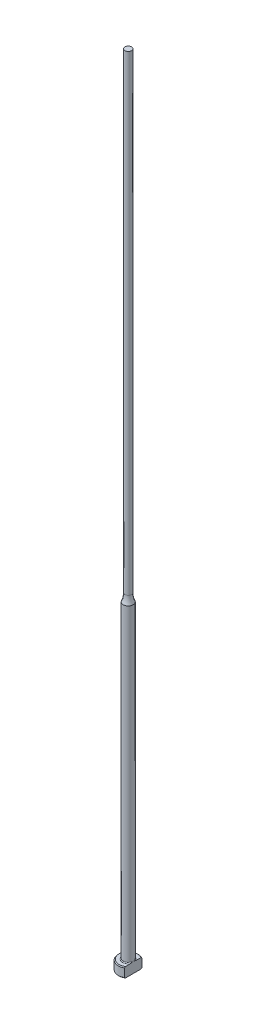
ISO-10303-21;
HEADER;
FILE_DESCRIPTION(('STEP AP214'),'2;1');
FILE_NAME('part.step','',(''),(''),'','','');
FILE_SCHEMA(('AUTOMOTIVE_DESIGN { 1 0 10303 214 1 1 1 1 }'));
ENDSEC;
DATA;
#1=APPLICATION_CONTEXT('core data for automotive mechanical design processes');
#2=APPLICATION_PROTOCOL_DEFINITION('international standard','automotive_design',2000,#1);
#3=PRODUCT_CONTEXT('',#1,'mechanical');
#4=PRODUCT('Part','Part','',(#3));
#5=PRODUCT_RELATED_PRODUCT_CATEGORY('part','',(#4));
#6=PRODUCT_DEFINITION_FORMATION('','',#4);
#7=PRODUCT_DEFINITION_CONTEXT('part definition',#1,'design');
#8=PRODUCT_DEFINITION('design','',#6,#7);
#9=PRODUCT_DEFINITION_SHAPE('','',#8);
#10=(LENGTH_UNIT() NAMED_UNIT(*) SI_UNIT(.MILLI.,.METRE.));
#11=(NAMED_UNIT(*) PLANE_ANGLE_UNIT() SI_UNIT($,.RADIAN.));
#12=(NAMED_UNIT(*) SI_UNIT($,.STERADIAN.) SOLID_ANGLE_UNIT());
#13=UNCERTAINTY_MEASURE_WITH_UNIT(LENGTH_MEASURE(1.E-05),#10,'distance_accuracy_value','');
#14=(GEOMETRIC_REPRESENTATION_CONTEXT(3) GLOBAL_UNCERTAINTY_ASSIGNED_CONTEXT((#13)) GLOBAL_UNIT_ASSIGNED_CONTEXT((#10,
#11,#12)) REPRESENTATION_CONTEXT('',''));
#15=CARTESIAN_POINT('',(0.,0.,0.));
#16=DIRECTION('',(0.,0.,1.));
#17=DIRECTION('',(1.,0.,0.));
#18=AXIS2_PLACEMENT_3D('',#15,#16,#17);
#19=CARTESIAN_POINT('',(-3.17499999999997,3.175,0.));
#20=DIRECTION('',(0.,1.,0.));
#21=DIRECTION('',(0.,0.,1.));
#22=AXIS2_PLACEMENT_3D('',#19,#20,#21);
#23=PLANE('',#22);
#24=CARTESIAN_POINT('',(0.,3.175,0.));
#25=DIRECTION('',(0.,1.,0.));
#26=DIRECTION('',(0.,0.,1.));
#27=AXIS2_PLACEMENT_3D('',#24,#25,#26);
#28=CIRCLE('',#27,2.92099999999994);
#29=CARTESIAN_POINT('',(1.58749999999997,3.175,-2.45195529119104));
#30=VERTEX_POINT('',#29);
#31=CARTESIAN_POINT('',(1.58749999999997,3.175,2.45195529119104));
#32=VERTEX_POINT('',#31);
#33=EDGE_CURVE('E105',#30,#32,#28,.T.);
#34=ORIENTED_EDGE('',*,*,#33,.T.);
#35=DIRECTION('',(0.,0.,1.));
#36=VECTOR('',#35,1.);
#37=CARTESIAN_POINT('',(1.58749999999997,3.17499999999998,2.74963065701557));
#38=LINE('',#37,#36);
#39=CARTESIAN_POINT('',(1.58749999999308,3.175,0.933255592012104));
#40=VERTEX_POINT('',#39);
#41=EDGE_CURVE('E126',#40,#32,#38,.T.);
#42=ORIENTED_EDGE('',*,*,#41,.F.);
#43=CARTESIAN_POINT('',(0.,3.175,0.));
#44=DIRECTION('',(0.,1.,0.));
#45=DIRECTION('',(0.,0.,1.));
#46=AXIS2_PLACEMENT_3D('',#43,#44,#45);
#47=CIRCLE('',#46,1.84149999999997);
#48=CARTESIAN_POINT('',(1.58749999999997,3.17500000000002,-0.933255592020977));
#49=VERTEX_POINT('',#48);
#50=EDGE_CURVE('E11',#40,#49,#47,.F.);
#51=ORIENTED_EDGE('',*,*,#50,.T.);
#52=EDGE_CURVE('E52',#30,#49,#38,.T.);
#53=ORIENTED_EDGE('',*,*,#52,.F.);
#54=EDGE_LOOP('',(#34,#42,#51,#53));
#55=FACE_BOUND('',#54,.T.);
#56=ADVANCED_FACE('F32',(#55),#23,.T.);
#57=CARTESIAN_POINT('',(0.,259.958771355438,0.));
#58=DIRECTION('',(0.,1.,0.));
#59=DIRECTION('',(0.,0.,1.));
#60=AXIS2_PLACEMENT_3D('',#57,#58,#59);
#61=CYLINDRICAL_SURFACE('',#60,3.17499999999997);
#62=CARTESIAN_POINT('',(0.,2.92100000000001,0.));
#63=DIRECTION('',(0.,1.,0.));
#64=DIRECTION('',(0.,0.,1.));
#65=AXIS2_PLACEMENT_3D('',#62,#63,#64);
#66=CIRCLE('',#65,3.17499999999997);
#67=CARTESIAN_POINT('',(1.58749999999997,2.92100000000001,2.74963065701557));
#68=VERTEX_POINT('',#67);
#69=CARTESIAN_POINT('',(1.58749999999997,2.92100000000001,-2.74963065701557));
#70=VERTEX_POINT('',#69);
#71=EDGE_CURVE('E98',#68,#70,#66,.F.);
#72=ORIENTED_EDGE('',*,*,#71,.T.);
#73=DIRECTION('',(0.,-1.,0.));
#74=VECTOR('',#73,1.);
#75=CARTESIAN_POINT('',(1.58749999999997,254.001,-2.74963065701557));
#76=LINE('',#75,#74);
#77=CARTESIAN_POINT('',(1.58749999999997,0.253999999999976,-2.74963065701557));
#78=VERTEX_POINT('',#77);
#79=EDGE_CURVE('E141',#70,#78,#76,.T.);
#80=ORIENTED_EDGE('',*,*,#79,.T.);
#81=CARTESIAN_POINT('',(0.,0.253999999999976,0.));
#82=DIRECTION('',(0.,-1.,0.));
#83=DIRECTION('',(0.,0.,-1.));
#84=AXIS2_PLACEMENT_3D('',#81,#82,#83);
#85=CIRCLE('',#84,3.17499999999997);
#86=CARTESIAN_POINT('',(1.58749999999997,0.253999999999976,2.74963065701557));
#87=VERTEX_POINT('',#86);
#88=EDGE_CURVE('E95',#78,#87,#85,.F.);
#89=ORIENTED_EDGE('',*,*,#88,.T.);
#90=DIRECTION('',(0.,-1.,0.));
#91=VECTOR('',#90,1.);
#92=CARTESIAN_POINT('',(1.58749999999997,254.001,2.74963065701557));
#93=LINE('',#92,#91);
#94=EDGE_CURVE('E88',#68,#87,#93,.T.);
#95=ORIENTED_EDGE('',*,*,#94,.F.);
#96=EDGE_LOOP('',(#72,#80,#89,#95));
#97=FACE_BOUND('',#96,.T.);
#98=ADVANCED_FACE('F191',(#97),#61,.T.);
#99=CARTESIAN_POINT('',(0.,0.,0.));
#100=DIRECTION('',(0.,-1.,0.));
#101=DIRECTION('',(0.,0.,-1.));
#102=AXIS2_PLACEMENT_3D('',#99,#100,#101);
#103=PLANE('',#102);
#104=CARTESIAN_POINT('',(0.,0.,0.));
#105=DIRECTION('',(0.,-1.,0.));
#106=DIRECTION('',(0.,0.,-1.));
#107=AXIS2_PLACEMENT_3D('',#104,#105,#106);
#108=CIRCLE('',#107,2.92100000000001);
#109=CARTESIAN_POINT('',(1.58749999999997,0.,2.45195529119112));
#110=VERTEX_POINT('',#109);
#111=CARTESIAN_POINT('',(1.58749999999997,0.,-2.45195529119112));
#112=VERTEX_POINT('',#111);
#113=EDGE_CURVE('E93',#110,#112,#108,.T.);
#114=ORIENTED_EDGE('',*,*,#113,.T.);
#115=DIRECTION('',(0.,0.,1.));
#116=VECTOR('',#115,1.);
#117=CARTESIAN_POINT('',(1.58749999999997,0.,2.74963065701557));
#118=LINE('',#117,#116);
#119=EDGE_CURVE('E78',#112,#110,#118,.T.);
#120=ORIENTED_EDGE('',*,*,#119,.T.);
#121=EDGE_LOOP('',(#114,#120));
#122=FACE_BOUND('',#121,.T.);
#123=ADVANCED_FACE('F97',(#122),#103,.T.);
#124=CARTESIAN_POINT('',(0.,3.17499999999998,0.));
#125=DIRECTION('',(0.,-1.,0.));
#126=DIRECTION('',(0.,0.,-1.));
#127=AXIS2_PLACEMENT_3D('',#124,#125,#126);
#128=CONICAL_SURFACE('',#127,2.92099999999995,0.785398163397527);
#129=ORIENTED_EDGE('',*,*,#71,.F.);
#130=CARTESIAN_POINT('',(1.58749999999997,-0.16162066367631,-6.0529050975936));
#131=CARTESIAN_POINT('',(1.58749999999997,-0.0288893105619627,-5.91567682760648));
#132=CARTESIAN_POINT('',(1.58749999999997,0.103699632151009,-5.7783103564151));
#133=CARTESIAN_POINT('',(1.58749999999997,0.368508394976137,-5.50321874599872));
#134=CARTESIAN_POINT('',(1.58749999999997,0.500728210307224,-5.36549360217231));
#135=CARTESIAN_POINT('',(1.58749999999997,0.764778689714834,-5.08953516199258));
#136=CARTESIAN_POINT('',(1.58749999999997,0.896609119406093,-4.9513016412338));
#137=CARTESIAN_POINT('',(1.58749999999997,1.15968706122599,-4.67428233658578));
#138=CARTESIAN_POINT('',(1.58749999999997,1.29093457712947,-4.53549655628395));
#139=CARTESIAN_POINT('',(1.58749999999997,1.55007705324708,-4.25997724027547));
#140=CARTESIAN_POINT('',(1.58749999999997,1.67798684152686,-4.12325766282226));
#141=CARTESIAN_POINT('',(1.58749999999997,1.9328486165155,-3.84892898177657));
#142=CARTESIAN_POINT('',(1.58749999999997,2.05980060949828,-3.71131988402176));
#143=CARTESIAN_POINT('',(1.58749999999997,2.31237508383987,-3.43493978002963));
#144=CARTESIAN_POINT('',(1.58749999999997,2.43799784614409,-3.29616903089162));
#145=CARTESIAN_POINT('',(1.58749999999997,2.68741369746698,-3.01699558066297));
#146=CARTESIAN_POINT('',(1.58749999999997,2.81120686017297,-2.8765929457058));
#147=CARTESIAN_POINT('',(1.58749999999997,3.00875865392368,-2.64816703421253));
#148=CARTESIAN_POINT('',(1.58749999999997,3.08336151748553,-2.56087478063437));
#149=CARTESIAN_POINT('',(1.58749999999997,3.2312387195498,-2.38515423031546));
#150=CARTESIAN_POINT('',(1.58749999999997,3.30451292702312,-2.29672582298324));
#151=CARTESIAN_POINT('',(1.58749999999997,3.45004422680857,-2.1174740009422));
#152=CARTESIAN_POINT('',(1.58749999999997,3.5222823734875,-2.02663514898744));
#153=CARTESIAN_POINT('',(1.58749999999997,3.66423097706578,-1.8430252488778));
#154=CARTESIAN_POINT('',(1.58749999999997,3.73394203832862,-1.75025467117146));
#155=CARTESIAN_POINT('',(1.58749999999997,3.87080633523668,-1.5606747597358));
#156=CARTESIAN_POINT('',(1.58749999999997,3.93790459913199,-1.46382547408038));
#157=CARTESIAN_POINT('',(1.58749999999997,4.06669147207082,-1.26632594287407));
#158=CARTESIAN_POINT('',(1.58749999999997,4.1283726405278,-1.16567073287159));
#159=CARTESIAN_POINT('',(1.58749999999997,4.21402252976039,-1.01165766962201));
#160=CARTESIAN_POINT('',(1.58749999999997,4.24127929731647,-0.960142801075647));
#161=CARTESIAN_POINT('',(1.58749999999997,4.2930979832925,-0.855780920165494));
#162=CARTESIAN_POINT('',(1.58749999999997,4.31765941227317,-0.802933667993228));
#163=CARTESIAN_POINT('',(1.58749999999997,4.38614656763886,-0.642461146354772));
#164=CARTESIAN_POINT('',(1.58749999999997,4.42510149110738,-0.532518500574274));
#165=CARTESIAN_POINT('',(1.58749999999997,4.46726244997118,-0.367680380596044));
#166=CARTESIAN_POINT('',(1.58749999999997,4.47844427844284,-0.314802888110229));
#167=CARTESIAN_POINT('',(1.58749999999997,4.49576654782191,-0.208209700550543));
#168=CARTESIAN_POINT('',(1.58749999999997,4.50190743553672,-0.154494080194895));
#169=CARTESIAN_POINT('',(1.58749999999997,4.50871296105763,-0.0468792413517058));
#170=CARTESIAN_POINT('',(1.58749999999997,4.5093945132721,0.00701889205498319));
#171=CARTESIAN_POINT('',(1.58749999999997,4.50527679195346,0.114606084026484));
#172=CARTESIAN_POINT('',(1.58749999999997,4.50047706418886,0.168295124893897));
#173=CARTESIAN_POINT('',(1.58749999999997,4.48579689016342,0.27448544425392));
#174=CARTESIAN_POINT('',(1.58749999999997,4.47596081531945,0.32699298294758));
#175=CARTESIAN_POINT('',(1.58749999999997,4.45181809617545,0.430974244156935));
#176=CARTESIAN_POINT('',(1.58749999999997,4.4375096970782,0.482447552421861));
#177=CARTESIAN_POINT('',(1.58749999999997,4.40502489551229,0.584460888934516));
#178=CARTESIAN_POINT('',(1.58749999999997,4.386827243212,0.634994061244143));
#179=CARTESIAN_POINT('',(1.58749999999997,4.34729308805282,0.734789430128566));
#180=CARTESIAN_POINT('',(1.58749999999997,4.3259572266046,0.784051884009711));
#181=CARTESIAN_POINT('',(1.58749999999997,4.25791922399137,0.930549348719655));
#182=CARTESIAN_POINT('',(1.58749999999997,4.20736047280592,1.0259880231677));
#183=CARTESIAN_POINT('',(1.58749999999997,4.0995545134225,1.21304313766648));
#184=CARTESIAN_POINT('',(1.58749999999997,4.04229912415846,1.30465471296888));
#185=CARTESIAN_POINT('',(1.58749999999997,3.92308746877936,1.48526211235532));
#186=CARTESIAN_POINT('',(1.58749999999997,3.86111349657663,1.57424615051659));
#187=CARTESIAN_POINT('',(1.58749999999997,3.73408621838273,1.74990003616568));
#188=CARTESIAN_POINT('',(1.58749999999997,3.66903444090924,1.83657099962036));
#189=CARTESIAN_POINT('',(1.58749999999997,3.53583371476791,2.00931764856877));
#190=CARTESIAN_POINT('',(1.58749999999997,3.46765527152,2.09537048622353));
#191=CARTESIAN_POINT('',(1.58749999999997,3.32960643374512,2.26611736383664));
#192=CARTESIAN_POINT('',(1.58749999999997,3.25973586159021,2.35081125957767));
#193=CARTESIAN_POINT('',(1.58749999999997,3.04858139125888,2.60290121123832));
#194=CARTESIAN_POINT('',(1.58749999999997,2.90542388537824,2.76872537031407));
#195=CARTESIAN_POINT('',(1.58749999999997,2.64069522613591,3.06970913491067));
#196=CARTESIAN_POINT('',(1.58749999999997,2.51959458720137,3.20528660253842));
#197=CARTESIAN_POINT('',(1.58749999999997,2.27590400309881,3.47510321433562));
#198=CARTESIAN_POINT('',(1.58749999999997,2.15331401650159,3.60934232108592));
#199=CARTESIAN_POINT('',(1.58749999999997,1.90694239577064,3.87695374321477));
#200=CARTESIAN_POINT('',(1.58749999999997,1.78315974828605,4.0103251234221));
#201=CARTESIAN_POINT('',(1.58749999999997,1.53478104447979,4.27630880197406));
#202=CARTESIAN_POINT('',(1.58749999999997,1.41018498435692,4.40892109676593));
#203=CARTESIAN_POINT('',(1.58749999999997,1.0457468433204,4.79499418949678));
#204=CARTESIAN_POINT('',(1.58749999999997,0.80507680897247,5.04767313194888));
#205=CARTESIAN_POINT('',(1.58749999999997,0.443121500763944,5.42550911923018));
#206=CARTESIAN_POINT('',(1.58749999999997,0.322378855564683,5.55118772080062));
#207=CARTESIAN_POINT('',(1.58749999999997,0.0805914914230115,5.80225207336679));
#208=CARTESIAN_POINT('',(1.58749999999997,-0.040453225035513,5.92763782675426));
#209=CARTESIAN_POINT('',(1.58749999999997,-0.161620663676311,6.0529050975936));
#210=B_SPLINE_CURVE_WITH_KNOTS('',3,(#130,#131,#132,#133,#134,#135,#136,#137,#138,#139,#140,
#141,#142,#143,#144,#145,#146,#147,#148,#149,#150,#151,#152,#153,#154,#155,#156,#157,#158,#159,
#160,#161,#162,#163,#164,#165,#166,#167,#168,#169,#170,#171,#172,#173,#174,#175,#176,#177,#178,
#179,#180,#181,#182,#183,#184,#185,#186,#187,#188,#189,#190,#191,#192,#193,#194,#195,#196,#197,
#198,#199,#200,#201,#202,#203,#204,#205,#206,#207,#208,#209),.UNSPECIFIED.,.F.,.F.,(4,2,2,2,2,2,
2,2,2,2,2,2,2,2,2,2,2,2,2,2,2,2,2,2,2,2,2,2,2,2,2,2,2,2,2,2,2,2,2,4),(0.,0.572750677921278,
1.14550874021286,1.71856057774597,2.29160869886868,2.85328006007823,3.4149477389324,
3.97649423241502,4.53801804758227,4.88249307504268,5.22700189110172,5.5751532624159,
5.92322081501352,6.27657800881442,6.63041319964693,6.80518126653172,6.9799810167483,
7.3282426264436,7.49018491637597,7.65211285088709,7.81353889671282,7.97497832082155,
8.13501929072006,8.29512313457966,8.45612518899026,8.61709438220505,8.94062993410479,
9.2645649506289,9.58978187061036,9.91483894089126,10.2441741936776,10.5735441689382,
11.2306812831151,11.7760337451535,12.3214014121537,12.8672825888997,13.4131663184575,
14.4600164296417,14.9828595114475,15.5056983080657),.UNSPECIFIED.);
#211=EDGE_CURVE('E118',#32,#68,#210,.T.);
#212=ORIENTED_EDGE('',*,*,#211,.F.);
#213=ORIENTED_EDGE('',*,*,#33,.F.);
#214=EDGE_CURVE('E117',#70,#30,#210,.T.);
#215=ORIENTED_EDGE('',*,*,#214,.F.);
#216=EDGE_LOOP('',(#129,#212,#213,#215));
#217=FACE_BOUND('',#216,.T.);
#218=ADVANCED_FACE('F162',(#217),#128,.T.);
#219=CARTESIAN_POINT('',(0.,0.253999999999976,0.));
#220=DIRECTION('',(0.,1.,0.));
#221=DIRECTION('',(0.,0.,1.));
#222=AXIS2_PLACEMENT_3D('',#219,#220,#221);
#223=CONICAL_SURFACE('',#222,3.17499999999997,0.785398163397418);
#224=ORIENTED_EDGE('',*,*,#88,.F.);
#225=CARTESIAN_POINT('',(1.58749999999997,3.33662066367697,6.0529050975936));
#226=CARTESIAN_POINT('',(1.58749999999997,3.20388931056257,5.91567682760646));
#227=CARTESIAN_POINT('',(1.58749999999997,3.07130036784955,5.77831035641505));
#228=CARTESIAN_POINT('',(1.58749999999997,2.80649160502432,5.50321874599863));
#229=CARTESIAN_POINT('',(1.58749999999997,2.67427178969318,5.3654936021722));
#230=CARTESIAN_POINT('',(1.58749999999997,2.41022131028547,5.08953516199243));
#231=CARTESIAN_POINT('',(1.58749999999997,2.27839088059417,4.95130164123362));
#232=CARTESIAN_POINT('',(1.58749999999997,2.01531293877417,4.67428233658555));
#233=CARTESIAN_POINT('',(1.58749999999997,1.88406542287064,4.5354965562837));
#234=CARTESIAN_POINT('',(1.58749999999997,1.62492294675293,4.25997724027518));
#235=CARTESIAN_POINT('',(1.58749999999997,1.49701315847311,4.12325766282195));
#236=CARTESIAN_POINT('',(1.58749999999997,1.24215138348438,3.84892898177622));
#237=CARTESIAN_POINT('',(1.58749999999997,1.11519939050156,3.71131988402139));
#238=CARTESIAN_POINT('',(1.58749999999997,0.862624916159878,3.43493978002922));
#239=CARTESIAN_POINT('',(1.58749999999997,0.737002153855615,3.29616903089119));
#240=CARTESIAN_POINT('',(1.58749999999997,0.487586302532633,3.01699558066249));
#241=CARTESIAN_POINT('',(1.58749999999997,0.363793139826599,2.8765929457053));
#242=CARTESIAN_POINT('',(1.58749999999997,0.166241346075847,2.64816703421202));
#243=CARTESIAN_POINT('',(1.58749999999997,0.0916384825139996,2.56087478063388));
#244=CARTESIAN_POINT('',(1.58749999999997,-0.0562387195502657,2.385154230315));
#245=CARTESIAN_POINT('',(1.58749999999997,-0.129512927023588,2.29672582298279));
#246=CARTESIAN_POINT('',(1.58749999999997,-0.27504422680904,2.11747400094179));
#247=CARTESIAN_POINT('',(1.58749999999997,-0.347282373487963,2.02663514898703));
#248=CARTESIAN_POINT('',(1.58749999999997,-0.489230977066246,1.84302524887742));
#249=CARTESIAN_POINT('',(1.58749999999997,-0.558942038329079,1.7502546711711));
#250=CARTESIAN_POINT('',(1.58749999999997,-0.695806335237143,1.56067475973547));
#251=CARTESIAN_POINT('',(1.58749999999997,-0.762904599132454,1.46382547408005));
#252=CARTESIAN_POINT('',(1.58749999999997,-0.891691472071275,1.26632594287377));
#253=CARTESIAN_POINT('',(1.58749999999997,-0.953372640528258,1.16567073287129));
#254=CARTESIAN_POINT('',(1.58749999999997,-1.03902252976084,1.01165766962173));
#255=CARTESIAN_POINT('',(1.58749999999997,-1.06627929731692,0.960142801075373));
#256=CARTESIAN_POINT('',(1.58749999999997,-1.11809798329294,0.85578092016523));
#257=CARTESIAN_POINT('',(1.58749999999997,-1.14265941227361,0.802933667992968));
#258=CARTESIAN_POINT('',(1.58749999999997,-1.21114656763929,0.642461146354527));
#259=CARTESIAN_POINT('',(1.58749999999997,-1.2501014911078,0.532518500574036));
#260=CARTESIAN_POINT('',(1.58749999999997,-1.29226244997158,0.367680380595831));
#261=CARTESIAN_POINT('',(1.58749999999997,-1.30344427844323,0.314802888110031));
#262=CARTESIAN_POINT('',(1.58749999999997,-1.32076654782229,0.208209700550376));
#263=CARTESIAN_POINT('',(1.58749999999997,-1.3269074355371,0.154494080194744));
#264=CARTESIAN_POINT('',(1.58749999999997,-1.333712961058,0.0468792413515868));
#265=CARTESIAN_POINT('',(1.58749999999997,-1.33439451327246,-0.00701889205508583));
#266=CARTESIAN_POINT('',(1.58749999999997,-1.33027679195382,-0.114606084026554));
#267=CARTESIAN_POINT('',(1.58749999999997,-1.32547706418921,-0.168295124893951));
#268=CARTESIAN_POINT('',(1.58749999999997,-1.31079689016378,-0.274485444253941));
#269=CARTESIAN_POINT('',(1.58749999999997,-1.3009608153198,-0.326992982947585));
#270=CARTESIAN_POINT('',(1.58749999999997,-1.27681809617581,-0.430974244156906));
#271=CARTESIAN_POINT('',(1.58749999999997,-1.26250969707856,-0.482447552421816));
#272=CARTESIAN_POINT('',(1.58749999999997,-1.23002489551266,-0.584460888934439));
#273=CARTESIAN_POINT('',(1.58749999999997,-1.21182724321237,-0.634994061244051));
#274=CARTESIAN_POINT('',(1.58749999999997,-1.1722930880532,-0.734789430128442));
#275=CARTESIAN_POINT('',(1.58749999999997,-1.15095722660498,-0.784051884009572));
#276=CARTESIAN_POINT('',(1.58749999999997,-1.08291922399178,-0.93054934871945));
#277=CARTESIAN_POINT('',(1.58749999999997,-1.03236047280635,-1.02598802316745));
#278=CARTESIAN_POINT('',(1.58749999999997,-0.924554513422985,-1.21304313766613));
#279=CARTESIAN_POINT('',(1.58749999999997,-0.86729912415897,-1.30465471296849));
#280=CARTESIAN_POINT('',(1.58749999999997,-0.748087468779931,-1.48526211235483));
#281=CARTESIAN_POINT('',(1.58749999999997,-0.686113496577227,-1.57424615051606));
#282=CARTESIAN_POINT('',(1.58749999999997,-0.55908621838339,-1.74990003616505));
#283=CARTESIAN_POINT('',(1.58749999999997,-0.494034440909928,-1.83657099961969));
#284=CARTESIAN_POINT('',(1.58749999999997,-0.360833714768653,-2.00931764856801));
#285=CARTESIAN_POINT('',(1.58749999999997,-0.292655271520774,-2.09537048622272));
#286=CARTESIAN_POINT('',(1.58749999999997,-0.154606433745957,-2.26611736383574));
#287=CARTESIAN_POINT('',(1.58749999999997,-0.0847358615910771,-2.35081125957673));
#288=CARTESIAN_POINT('',(1.58749999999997,0.126418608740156,-2.60290121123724));
#289=CARTESIAN_POINT('',(1.58749999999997,0.269576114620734,-2.76872537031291));
#290=CARTESIAN_POINT('',(1.58749999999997,0.534304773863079,-3.06970913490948));
#291=CARTESIAN_POINT('',(1.58749999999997,0.655405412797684,-3.20528660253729));
#292=CARTESIAN_POINT('',(1.58749999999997,0.899095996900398,-3.47510321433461));
#293=CARTESIAN_POINT('',(1.58749999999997,1.02168598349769,-3.60934232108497));
#294=CARTESIAN_POINT('',(1.58749999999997,1.26805760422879,-3.87695374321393));
#295=CARTESIAN_POINT('',(1.58749999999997,1.39184025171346,-4.01032512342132));
#296=CARTESIAN_POINT('',(1.58749999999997,1.64021895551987,-4.2763088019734));
#297=CARTESIAN_POINT('',(1.58749999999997,1.76481501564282,-4.40892109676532));
#298=CARTESIAN_POINT('',(1.58749999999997,2.12925315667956,-4.79499418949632));
#299=CARTESIAN_POINT('',(1.58749999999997,2.36992319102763,-5.04767313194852));
#300=CARTESIAN_POINT('',(1.58749999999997,2.73187849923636,-5.42550911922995));
#301=CARTESIAN_POINT('',(1.58749999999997,2.85262114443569,-5.55118772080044));
#302=CARTESIAN_POINT('',(1.58749999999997,3.09440850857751,-5.8022520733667));
#303=CARTESIAN_POINT('',(1.58749999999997,3.2154532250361,-5.92763782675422));
#304=CARTESIAN_POINT('',(1.58749999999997,3.33662066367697,-6.0529050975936));
#305=B_SPLINE_CURVE_WITH_KNOTS('',3,(#225,#226,#227,#228,#229,#230,#231,#232,#233,#234,#235,
#236,#237,#238,#239,#240,#241,#242,#243,#244,#245,#246,#247,#248,#249,#250,#251,#252,#253,#254,
#255,#256,#257,#258,#259,#260,#261,#262,#263,#264,#265,#266,#267,#268,#269,#270,#271,#272,#273,
#274,#275,#276,#277,#278,#279,#280,#281,#282,#283,#284,#285,#286,#287,#288,#289,#290,#291,#292,
#293,#294,#295,#296,#297,#298,#299,#300,#301,#302,#303,#304),.UNSPECIFIED.,.F.,.F.,(4,2,2,2,2,2,
2,2,2,2,2,2,2,2,2,2,2,2,2,2,2,2,2,2,2,2,2,2,2,2,2,2,2,2,2,2,2,2,2,4),(0.,0.57275067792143,
1.14550874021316,1.71856057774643,2.29160869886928,2.85328006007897,3.41494773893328,
3.97649423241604,4.53801804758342,4.88249307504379,5.2270018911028,5.57515326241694,
5.92322081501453,6.27657800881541,6.63041319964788,6.80518126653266,6.97998101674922,
7.32824262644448,7.49018491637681,7.65211285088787,7.81353889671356,7.97497832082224,
8.1350192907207,8.29512313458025,8.45612518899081,8.61709438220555,8.94062993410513,
9.26456495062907,9.58978187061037,9.91483894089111,10.2441741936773,10.5735441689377,
11.2306812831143,11.776033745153,12.3214014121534,12.8672825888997,13.4131663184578,
14.4600164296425,14.9828595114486,15.505698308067),.UNSPECIFIED.);
#306=EDGE_CURVE('E81',#112,#78,#305,.T.);
#307=ORIENTED_EDGE('',*,*,#306,.F.);
#308=ORIENTED_EDGE('',*,*,#113,.F.);
#309=EDGE_CURVE('E84',#87,#110,#305,.T.);
#310=ORIENTED_EDGE('',*,*,#309,.F.);
#311=EDGE_LOOP('',(#224,#307,#308,#310));
#312=FACE_BOUND('',#311,.T.);
#313=ADVANCED_FACE('F92',(#312),#223,.T.);
#314=CARTESIAN_POINT('',(0.,3.42900000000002,0.));
#315=DIRECTION('',(0.,1.,0.));
#316=DIRECTION('',(0.,0.,1.));
#317=AXIS2_PLACEMENT_3D('',#314,#315,#316);
#318=TOROIDAL_SURFACE('',#317,1.84149999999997,0.254);
#319=CARTESIAN_POINT('',(1.58749999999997,3.42900000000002,0.));
#320=CARTESIAN_POINT('',(1.58749999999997,3.42899942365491,-1.9220514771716E-10));
#321=CARTESIAN_POINT('',(1.58749999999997,3.42899884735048,-1.2261161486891E-07));
#322=CARTESIAN_POINT('',(1.58749999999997,3.42899773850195,-5.09676365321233E-07));
#323=CARTESIAN_POINT('',(1.58749999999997,3.42899720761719,-7.78176328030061E-07));
#324=CARTESIAN_POINT('',(1.58749999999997,3.42899614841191,-1.42307272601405E-06));
#325=CARTESIAN_POINT('',(1.58749999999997,3.42899562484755,-1.80713867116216E-06));
#326=CARTESIAN_POINT('',(1.58749999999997,3.42899463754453,-2.63494846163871E-06));
#327=CARTESIAN_POINT('',(1.58749999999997,3.42899417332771,-3.07814756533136E-06));
#328=CARTESIAN_POINT('',(1.58749999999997,3.42899261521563,-4.66897357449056E-06));
#329=CARTESIAN_POINT('',(1.58749999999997,3.42899159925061,-5.89404908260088E-06));
#330=CARTESIAN_POINT('',(1.58749999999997,3.42898979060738,-8.42427511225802E-06));
#331=CARTESIAN_POINT('',(1.58749999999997,3.42898899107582,-9.7248057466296E-06));
#332=CARTESIAN_POINT('',(1.58749999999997,3.42898598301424,-1.48060601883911E-05));
#333=CARTESIAN_POINT('',(1.58749999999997,3.42898393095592,-1.86838281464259E-05));
#334=CARTESIAN_POINT('',(1.58749999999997,3.42898057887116,-2.63261117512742E-05));
#335=CARTESIAN_POINT('',(1.58749999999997,3.42897922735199,-3.00687417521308E-05));
#336=CARTESIAN_POINT('',(1.58749999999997,3.42897347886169,-4.60276298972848E-05));
#337=CARTESIAN_POINT('',(1.58749999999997,3.42896911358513,-5.8247019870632E-05));
#338=CARTESIAN_POINT('',(1.58749999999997,3.42896211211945,-8.11070097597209E-05));
#339=CARTESIAN_POINT('',(1.58749999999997,3.42895931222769,-9.16953114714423E-05));
#340=CARTESIAN_POINT('',(1.58749999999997,3.42893712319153,-0.000168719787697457));
#341=CARTESIAN_POINT('',(1.58749999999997,3.42890881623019,-0.000232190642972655));
#342=CARTESIAN_POINT('',(1.58749999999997,3.42880276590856,-0.000479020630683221));
#343=CARTESIAN_POINT('',(1.58749999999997,3.42873165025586,-0.00066443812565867));
#344=CARTESIAN_POINT('',(1.58749999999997,3.42845137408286,-0.0013844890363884));
#345=CARTESIAN_POINT('',(1.58749999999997,3.42823526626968,-0.00191701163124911));
#346=CARTESIAN_POINT('',(1.58749999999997,3.42735449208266,-0.00409774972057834));
#347=CARTESIAN_POINT('',(1.58749999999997,3.42669768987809,-0.00574830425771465));
#348=CARTESIAN_POINT('',(1.58749999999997,3.4174405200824,-0.0289985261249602));
#349=CARTESIAN_POINT('',(1.58749999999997,3.40878325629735,-0.0505816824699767));
#350=CARTESIAN_POINT('',(1.58749999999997,3.39189297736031,-0.0929947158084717));
#351=CARTESIAN_POINT('',(1.58749999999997,3.38365605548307,-0.11382315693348));
#352=CARTESIAN_POINT('',(1.58749999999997,3.36635393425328,-0.157956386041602));
#353=CARTESIAN_POINT('',(1.58749999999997,3.35730391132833,-0.181267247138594));
#354=CARTESIAN_POINT('',(1.58749999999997,3.33936775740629,-0.228222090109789));
#355=CARTESIAN_POINT('',(1.58749999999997,3.33048420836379,-0.25186705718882));
#356=CARTESIAN_POINT('',(1.58749999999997,3.30894496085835,-0.310512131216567));
#357=CARTESIAN_POINT('',(1.58749999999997,3.29649449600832,-0.345588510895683));
#358=CARTESIAN_POINT('',(1.58749999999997,3.27296975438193,-0.415278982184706));
#359=CARTESIAN_POINT('',(1.58749999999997,3.26186987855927,-0.449884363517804));
#360=CARTESIAN_POINT('',(1.58749999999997,3.2395832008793,-0.524471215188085));
#361=CARTESIAN_POINT('',(1.58749999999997,3.22860862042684,-0.564517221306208));
#362=CARTESIAN_POINT('',(1.58749999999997,3.20902534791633,-0.645529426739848));
#363=CARTESIAN_POINT('',(1.58749999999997,3.20043582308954,-0.686500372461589));
#364=CARTESIAN_POINT('',(1.58749999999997,3.18611712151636,-0.771546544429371));
#365=CARTESIAN_POINT('',(1.58749999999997,3.18059550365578,-0.815658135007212));
#366=CARTESIAN_POINT('',(1.58749999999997,3.17455396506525,-0.904117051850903));
#367=CARTESIAN_POINT('',(1.58749999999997,3.17401361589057,-0.948462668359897));
#368=CARTESIAN_POINT('',(1.58749999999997,3.17898948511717,-1.02531896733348));
#369=CARTESIAN_POINT('',(1.58749999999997,3.1829739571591,-1.05792141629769));
#370=CARTESIAN_POINT('',(1.58749999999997,3.19569167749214,-1.12184393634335));
#371=CARTESIAN_POINT('',(1.58749999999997,3.20436049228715,-1.1531753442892));
#372=CARTESIAN_POINT('',(1.58749999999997,3.22236152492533,-1.19946468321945));
#373=CARTESIAN_POINT('',(1.58749999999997,3.2295150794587,-1.21526783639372));
#374=CARTESIAN_POINT('',(1.58749999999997,3.24587062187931,-1.24583726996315));
#375=CARTESIAN_POINT('',(1.58749999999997,3.25507530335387,-1.26060215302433));
#376=CARTESIAN_POINT('',(1.58749999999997,3.27378481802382,-1.28575815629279));
#377=CARTESIAN_POINT('',(1.58749999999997,3.28289001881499,-1.29644383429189));
#378=CARTESIAN_POINT('',(1.58749999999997,3.30268460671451,-1.31623154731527));
#379=CARTESIAN_POINT('',(1.58749999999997,3.31337067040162,-1.32533681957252));
#380=CARTESIAN_POINT('',(1.58749999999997,3.33349977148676,-1.33941140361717));
#381=CARTESIAN_POINT('',(1.58749999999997,3.34261446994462,-1.34484814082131));
#382=CARTESIAN_POINT('',(1.58749999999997,3.36161455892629,-1.35416329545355));
#383=CARTESIAN_POINT('',(1.58749999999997,3.37149946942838,-1.35804267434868));
#384=CARTESIAN_POINT('',(1.58749999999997,3.39188678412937,-1.36398436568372));
#385=CARTESIAN_POINT('',(1.58749999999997,3.40239309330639,-1.36603350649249));
#386=CARTESIAN_POINT('',(1.58749999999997,3.42360372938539,-1.3680840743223));
#387=CARTESIAN_POINT('',(1.58749999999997,3.43430795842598,-1.36808648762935));
#388=CARTESIAN_POINT('',(1.58749999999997,3.45433283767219,-1.36616208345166));
#389=CARTESIAN_POINT('',(1.58749999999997,3.46367506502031,-1.36444960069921));
#390=CARTESIAN_POINT('',(1.58749999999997,3.48195519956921,-1.35953338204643));
#391=CARTESIAN_POINT('',(1.58749999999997,3.49089304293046,-1.3563294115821));
#392=CARTESIAN_POINT('',(1.58749999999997,3.50850302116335,-1.34848006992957));
#393=CARTESIAN_POINT('',(1.58749999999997,3.5171531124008,-1.34378578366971));
#394=CARTESIAN_POINT('',(1.58749999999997,3.53371257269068,-1.33324445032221));
#395=CARTESIAN_POINT('',(1.58749999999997,3.54162163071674,-1.32739692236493));
#396=CARTESIAN_POINT('',(1.58749999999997,3.56107121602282,-1.31107304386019));
#397=CARTESIAN_POINT('',(1.58749999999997,3.57202221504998,-1.29989286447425));
#398=CARTESIAN_POINT('',(1.58749999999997,3.59202509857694,-1.27593566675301));
#399=CARTESIAN_POINT('',(1.58749999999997,3.60107086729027,-1.26315370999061));
#400=CARTESIAN_POINT('',(1.58749999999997,3.62186023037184,-1.22930733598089));
#401=CARTESIAN_POINT('',(1.58749999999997,3.63240584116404,-1.20751096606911));
#402=CARTESIAN_POINT('',(1.58749999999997,3.65004643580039,-1.16266144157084));
#403=CARTESIAN_POINT('',(1.58749999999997,3.65714435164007,-1.13960937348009));
#404=CARTESIAN_POINT('',(1.58749999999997,3.67265428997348,-1.07603916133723));
#405=CARTESIAN_POINT('',(1.58749999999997,3.67834921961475,-1.03486686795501));
#406=CARTESIAN_POINT('',(1.58749999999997,3.68382880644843,-0.951558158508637));
#407=CARTESIAN_POINT('',(1.58749999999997,3.68350976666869,-0.909417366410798));
#408=CARTESIAN_POINT('',(1.58749999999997,3.67745397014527,-0.811383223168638));
#409=CARTESIAN_POINT('',(1.58749999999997,3.66993873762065,-0.755610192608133));
#410=CARTESIAN_POINT('',(1.58749999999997,3.64933373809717,-0.644937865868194));
#411=CARTESIAN_POINT('',(1.58749999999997,3.63621897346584,-0.59004364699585));
#412=CARTESIAN_POINT('',(1.58749999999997,3.60740922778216,-0.485757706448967));
#413=CARTESIAN_POINT('',(1.58749999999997,3.59201096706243,-0.436281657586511));
#414=CARTESIAN_POINT('',(1.58749999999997,3.55922497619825,-0.338551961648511));
#415=CARTESIAN_POINT('',(1.58749999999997,3.5418584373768,-0.290291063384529));
#416=CARTESIAN_POINT('',(1.58749999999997,3.51760237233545,-0.225557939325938));
#417=CARTESIAN_POINT('',(1.58749999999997,3.51126413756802,-0.208874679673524));
#418=CARTESIAN_POINT('',(1.58749999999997,3.49830042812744,-0.17512392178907));
#419=CARTESIAN_POINT('',(1.58749999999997,3.49167176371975,-0.158057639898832));
#420=CARTESIAN_POINT('',(1.58749999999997,3.47585523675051,-0.117638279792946));
#421=CARTESIAN_POINT('',(1.58749999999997,3.46662970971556,-0.0943002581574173));
#422=CARTESIAN_POINT('',(1.58749999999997,3.44889695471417,-0.0497824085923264));
#423=CARTESIAN_POINT('',(1.58749999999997,3.44040039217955,-0.028598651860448));
#424=CARTESIAN_POINT('',(1.58749999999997,3.43130364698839,-0.00575168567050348));
#425=CARTESIAN_POINT('',(1.58749999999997,3.43064818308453,-0.00410451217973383));
#426=CARTESIAN_POINT('',(1.58749999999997,3.42976776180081,-0.00192459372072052));
#427=CARTESIAN_POINT('',(1.58749999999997,3.42955062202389,-0.00138952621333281));
#428=CARTESIAN_POINT('',(1.58749999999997,3.42926908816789,-0.000666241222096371));
#429=CARTESIAN_POINT('',(1.58749999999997,3.42919771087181,-0.000480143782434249));
#430=CARTESIAN_POINT('',(1.58749999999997,3.42909131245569,-0.000232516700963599));
#431=CARTESIAN_POINT('',(1.58749999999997,3.42906294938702,-0.000168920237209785));
#432=CARTESIAN_POINT('',(1.58749999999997,3.42904072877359,-9.17527162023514E-05));
#433=CARTESIAN_POINT('',(1.58749999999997,3.42903792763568,-8.11550293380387E-05));
#434=CARTESIAN_POINT('',(1.58749999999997,3.42903091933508,-5.82743948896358E-05));
#435=CARTESIAN_POINT('',(1.58749999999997,3.42902654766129,-4.60440001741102E-05));
#436=CARTESIAN_POINT('',(1.58749999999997,3.42902079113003,-3.00727682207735E-05));
#437=CARTESIAN_POINT('',(1.58749999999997,3.42901943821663,-2.63286807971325E-05));
#438=CARTESIAN_POINT('',(1.58749999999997,3.42901608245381,-1.86836529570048E-05));
#439=CARTESIAN_POINT('',(1.58749999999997,3.4290140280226,-1.48046517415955E-05));
#440=CARTESIAN_POINT('',(1.58749999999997,3.42901101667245,-9.72223943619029E-06));
#441=CARTESIAN_POINT('',(1.58749999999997,3.42901021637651,-8.42159649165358E-06));
#442=CARTESIAN_POINT('',(1.58749999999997,3.42900840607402,-5.89129729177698E-06));
#443=CARTESIAN_POINT('',(1.58749999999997,3.42900738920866,-4.66626867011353E-06));
#444=CARTESIAN_POINT('',(1.58749999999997,3.42900582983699,-3.07568803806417E-06));
#445=CARTESIAN_POINT('',(1.58749999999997,3.42900536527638,-2.63259565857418E-06));
#446=CARTESIAN_POINT('',(1.58749999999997,3.4290043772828,-1.80506085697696E-06));
#447=CARTESIAN_POINT('',(1.58749999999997,3.42900385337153,-1.42116387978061E-06));
#448=CARTESIAN_POINT('',(1.58749999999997,3.42900279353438,-7.76675643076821E-07));
#449=CARTESIAN_POINT('',(1.58749999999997,3.42900226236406,-5.08406487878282E-07));
#450=CARTESIAN_POINT('',(1.58749999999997,3.42900115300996,-1.21901887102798E-07));
#451=CARTESIAN_POINT('',(1.58749999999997,3.42900057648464,1.92251677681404E-10));
#452=CARTESIAN_POINT('',(1.58749999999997,3.42900000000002,0.));
#453=B_SPLINE_CURVE_WITH_KNOTS('',3,(#319,#320,#321,#322,#323,#324,#325,#326,#327,#328,#329,
#330,#331,#332,#333,#334,#335,#336,#337,#338,#339,#340,#341,#342,#343,#344,#345,#346,#347,#348,
#349,#350,#351,#352,#353,#354,#355,#356,#357,#358,#359,#360,#361,#362,#363,#364,#365,#366,#367,
#368,#369,#370,#371,#372,#373,#374,#375,#376,#377,#378,#379,#380,#381,#382,#383,#384,#385,#386,
#387,#388,#389,#390,#391,#392,#393,#394,#395,#396,#397,#398,#399,#400,#401,#402,#403,#404,#405,
#406,#407,#408,#409,#410,#411,#412,#413,#414,#415,#416,#417,#418,#419,#420,#421,#422,#423,#424,
#425,#426,#427,#428,#429,#430,#431,#432,#433,#434,#435,#436,#437,#438,#439,#440,#441,#442,#443,
#444,#445,#446,#447,#448,#449,#450,#451,#452),.UNSPECIFIED.,.T.,.F.,(4,2,2,2,2,2,2,2,2,2,2,2,2,
2,2,2,2,2,2,2,2,2,2,2,2,2,2,2,2,2,2,2,2,2,2,2,2,2,2,2,2,2,2,2,2,2,2,2,2,2,2,2,2,2,2,2,2,2,2,2,2,
2,2,2,2,2,4),(0.,1.72815458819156E-06,3.50429255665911E-06,5.44431004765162E-06,
7.3675525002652E-06,1.2119089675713E-05,1.66953775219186E-05,2.98160400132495E-05,
4.17409564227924E-05,8.0660475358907E-05,0.000113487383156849,0.000321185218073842,
0.000917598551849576,0.00264089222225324,0.00797105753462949,0.0777276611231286,
0.144923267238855,0.219939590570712,0.295714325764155,0.407362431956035,0.516367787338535,
0.640878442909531,0.766362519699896,0.899536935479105,1.03216495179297,1.13045740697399,
1.22743103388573,1.27935899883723,1.33135556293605,1.37333248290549,1.41522237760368,
1.44693946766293,1.47863694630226,1.51056074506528,1.54246916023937,1.57083210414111,
1.59919951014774,1.62861579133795,1.65804436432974,1.70472658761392,1.75155645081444,
1.82378709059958,1.89595619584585,2.01995471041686,2.1460932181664,2.31447224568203,
2.48361094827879,2.6389891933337,2.79283011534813,2.84637031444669,2.9012946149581,
2.97658236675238,3.04504771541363,3.05036697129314,3.05209849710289,3.05269709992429,
3.05290520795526,3.05293806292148,3.05297701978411,3.05298895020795,3.05300207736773,
3.05300665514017,3.0530114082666,3.05301333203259,3.05301527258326,3.05301704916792,
3.05301877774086),.UNSPECIFIED.);
#454=CARTESIAN_POINT('',(1.58749999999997,3.42900000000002,0.));
#455=VERTEX_POINT('',#454);
#456=EDGE_CURVE('E47',#455,#49,#453,.T.);
#457=ORIENTED_EDGE('',*,*,#456,.T.);
#458=ORIENTED_EDGE('',*,*,#50,.F.);
#459=CARTESIAN_POINT('',(1.58749999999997,3.42900000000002,0.));
#460=CARTESIAN_POINT('',(1.58749999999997,3.42900057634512,1.9220512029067E-10));
#461=CARTESIAN_POINT('',(1.58749999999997,3.42900115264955,1.22611614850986E-07));
#462=CARTESIAN_POINT('',(1.58749999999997,3.42900226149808,5.09676365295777E-07));
#463=CARTESIAN_POINT('',(1.58749999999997,3.42900279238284,7.78176328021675E-07));
#464=CARTESIAN_POINT('',(1.58749999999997,3.42900385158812,1.42307272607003E-06));
#465=CARTESIAN_POINT('',(1.58749999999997,3.42900437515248,1.80713867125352E-06));
#466=CARTESIAN_POINT('',(1.58749999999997,3.4290053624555,2.63494846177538E-06));
#467=CARTESIAN_POINT('',(1.58749999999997,3.42900582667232,3.0781475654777E-06));
#468=CARTESIAN_POINT('',(1.58749999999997,3.4290073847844,4.66897357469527E-06));
#469=CARTESIAN_POINT('',(1.58749999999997,3.42900840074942,5.89404908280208E-06));
#470=CARTESIAN_POINT('',(1.58749999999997,3.42901020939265,8.42427511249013E-06));
#471=CARTESIAN_POINT('',(1.58749999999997,3.42901100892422,9.72480574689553E-06));
#472=CARTESIAN_POINT('',(1.58749999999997,3.42901401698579,1.48060601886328E-05));
#473=CARTESIAN_POINT('',(1.58749999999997,3.42901606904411,1.86838281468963E-05));
#474=CARTESIAN_POINT('',(1.58749999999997,3.42901942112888,2.63261117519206E-05));
#475=CARTESIAN_POINT('',(1.58749999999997,3.42902077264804,3.00687417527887E-05));
#476=CARTESIAN_POINT('',(1.58749999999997,3.42902652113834,4.60276298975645E-05));
#477=CARTESIAN_POINT('',(1.58749999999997,3.4290308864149,5.82470198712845E-05));
#478=CARTESIAN_POINT('',(1.58749999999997,3.42903788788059,8.11070097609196E-05));
#479=CARTESIAN_POINT('',(1.58749999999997,3.42904068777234,9.16953114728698E-05));
#480=CARTESIAN_POINT('',(1.58749999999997,3.4290628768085,0.000168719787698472));
#481=CARTESIAN_POINT('',(1.58749999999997,3.42909118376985,0.000232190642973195));
#482=CARTESIAN_POINT('',(1.58749999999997,3.42919723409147,0.000479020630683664));
#483=CARTESIAN_POINT('',(1.58749999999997,3.42926834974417,0.000664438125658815));
#484=CARTESIAN_POINT('',(1.58749999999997,3.42954862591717,0.00138448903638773));
#485=CARTESIAN_POINT('',(1.58749999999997,3.42976473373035,0.00191701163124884));
#486=CARTESIAN_POINT('',(1.58749999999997,3.43064550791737,0.00409774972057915));
#487=CARTESIAN_POINT('',(1.58749999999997,3.43130231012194,0.00574830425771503));
#488=CARTESIAN_POINT('',(1.58749999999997,3.44055947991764,0.0289985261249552));
#489=CARTESIAN_POINT('',(1.58749999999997,3.44921674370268,0.0505816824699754));
#490=CARTESIAN_POINT('',(1.58749999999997,3.46610702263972,0.0929947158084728));
#491=CARTESIAN_POINT('',(1.58749999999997,3.47434394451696,0.11382315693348));
#492=CARTESIAN_POINT('',(1.58749999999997,3.49164606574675,0.157956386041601));
#493=CARTESIAN_POINT('',(1.58749999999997,3.5006960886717,0.181267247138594));
#494=CARTESIAN_POINT('',(1.58749999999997,3.51863224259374,0.228222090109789));
#495=CARTESIAN_POINT('',(1.58749999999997,3.52751579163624,0.25186705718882));
#496=CARTESIAN_POINT('',(1.58749999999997,3.54905503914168,0.310512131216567));
#497=CARTESIAN_POINT('',(1.58749999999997,3.56150550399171,0.345588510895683));
#498=CARTESIAN_POINT('',(1.58749999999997,3.5850302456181,0.415278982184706));
#499=CARTESIAN_POINT('',(1.58749999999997,3.59613012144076,0.449884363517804));
#500=CARTESIAN_POINT('',(1.58749999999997,3.61841679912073,0.524471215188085));
#501=CARTESIAN_POINT('',(1.58749999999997,3.62939137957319,0.564517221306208));
#502=CARTESIAN_POINT('',(1.58749999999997,3.6489746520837,0.645529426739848));
#503=CARTESIAN_POINT('',(1.58749999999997,3.65756417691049,0.686500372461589));
#504=CARTESIAN_POINT('',(1.58749999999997,3.67188287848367,0.771546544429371));
#505=CARTESIAN_POINT('',(1.58749999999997,3.67740449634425,0.815658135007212));
#506=CARTESIAN_POINT('',(1.58749999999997,3.68344603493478,0.904117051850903));
#507=CARTESIAN_POINT('',(1.58749999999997,3.68398638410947,0.948462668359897));
#508=CARTESIAN_POINT('',(1.58749999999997,3.67901051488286,1.02531896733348));
#509=CARTESIAN_POINT('',(1.58749999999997,3.67502604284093,1.05792141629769));
#510=CARTESIAN_POINT('',(1.58749999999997,3.66230832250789,1.12184393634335));
#511=CARTESIAN_POINT('',(1.58749999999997,3.65363950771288,1.1531753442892));
#512=CARTESIAN_POINT('',(1.58749999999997,3.6356384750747,1.19946468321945));
#513=CARTESIAN_POINT('',(1.58749999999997,3.62848492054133,1.21526783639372));
#514=CARTESIAN_POINT('',(1.58749999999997,3.61212937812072,1.24583726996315));
#515=CARTESIAN_POINT('',(1.58749999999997,3.60292469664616,1.26060215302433));
#516=CARTESIAN_POINT('',(1.58749999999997,3.58421518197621,1.28575815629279));
#517=CARTESIAN_POINT('',(1.58749999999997,3.57510998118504,1.29644383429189));
#518=CARTESIAN_POINT('',(1.58749999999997,3.55531539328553,1.31623154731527));
#519=CARTESIAN_POINT('',(1.58749999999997,3.54462932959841,1.32533681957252));
#520=CARTESIAN_POINT('',(1.58749999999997,3.52450022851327,1.33941140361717));
#521=CARTESIAN_POINT('',(1.58749999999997,3.51538553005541,1.34484814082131));
#522=CARTESIAN_POINT('',(1.58749999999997,3.49638544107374,1.35416329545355));
#523=CARTESIAN_POINT('',(1.58749999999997,3.48650053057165,1.35804267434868));
#524=CARTESIAN_POINT('',(1.58749999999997,3.46611321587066,1.36398436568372));
#525=CARTESIAN_POINT('',(1.58749999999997,3.45560690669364,1.36603350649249));
#526=CARTESIAN_POINT('',(1.58749999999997,3.43439627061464,1.3680840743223));
#527=CARTESIAN_POINT('',(1.58749999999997,3.42369204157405,1.36808648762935));
#528=CARTESIAN_POINT('',(1.58749999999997,3.40366716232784,1.36616208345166));
#529=CARTESIAN_POINT('',(1.58749999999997,3.39432493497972,1.36444960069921));
#530=CARTESIAN_POINT('',(1.58749999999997,3.37604480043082,1.35953338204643));
#531=CARTESIAN_POINT('',(1.58749999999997,3.36710695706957,1.3563294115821));
#532=CARTESIAN_POINT('',(1.58749999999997,3.34949697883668,1.34848006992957));
#533=CARTESIAN_POINT('',(1.58749999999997,3.34084688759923,1.34378578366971));
#534=CARTESIAN_POINT('',(1.58749999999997,3.32428742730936,1.33324445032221));
#535=CARTESIAN_POINT('',(1.58749999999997,3.31637836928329,1.32739692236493));
#536=CARTESIAN_POINT('',(1.58749999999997,3.29692878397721,1.31107304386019));
#537=CARTESIAN_POINT('',(1.58749999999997,3.28597778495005,1.29989286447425));
#538=CARTESIAN_POINT('',(1.58749999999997,3.26597490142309,1.27593566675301));
#539=CARTESIAN_POINT('',(1.58749999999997,3.25692913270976,1.26315370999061));
#540=CARTESIAN_POINT('',(1.58749999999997,3.23613976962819,1.22930733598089));
#541=CARTESIAN_POINT('',(1.58749999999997,3.22559415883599,1.20751096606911));
#542=CARTESIAN_POINT('',(1.58749999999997,3.20795356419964,1.16266144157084));
#543=CARTESIAN_POINT('',(1.58749999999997,3.20085564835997,1.13960937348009));
#544=CARTESIAN_POINT('',(1.58749999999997,3.18534571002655,1.07603916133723));
#545=CARTESIAN_POINT('',(1.58749999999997,3.17965078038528,1.03486686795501));
#546=CARTESIAN_POINT('',(1.58749999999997,3.1741711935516,0.951558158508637));
#547=CARTESIAN_POINT('',(1.58749999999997,3.17449023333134,0.909417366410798));
#548=CARTESIAN_POINT('',(1.58749999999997,3.18054602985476,0.811383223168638));
#549=CARTESIAN_POINT('',(1.58749999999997,3.18806126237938,0.755610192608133));
#550=CARTESIAN_POINT('',(1.58749999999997,3.20866626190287,0.644937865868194));
#551=CARTESIAN_POINT('',(1.58749999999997,3.2217810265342,0.59004364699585));
#552=CARTESIAN_POINT('',(1.58749999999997,3.25059077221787,0.485757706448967));
#553=CARTESIAN_POINT('',(1.58749999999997,3.2659890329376,0.43628165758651));
#554=CARTESIAN_POINT('',(1.58749999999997,3.29877502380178,0.338551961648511));
#555=CARTESIAN_POINT('',(1.58749999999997,3.31614156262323,0.290291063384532));
#556=CARTESIAN_POINT('',(1.58749999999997,3.34039762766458,0.225557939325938));
#557=CARTESIAN_POINT('',(1.58749999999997,3.346735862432,0.208874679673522));
#558=CARTESIAN_POINT('',(1.58749999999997,3.35969957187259,0.175123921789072));
#559=CARTESIAN_POINT('',(1.58749999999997,3.3663282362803,0.15805763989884));
#560=CARTESIAN_POINT('',(1.58749999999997,3.3821447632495,0.117638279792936));
#561=CARTESIAN_POINT('',(1.58749999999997,3.39137029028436,0.0943002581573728));
#562=CARTESIAN_POINT('',(1.58749999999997,3.40910304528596,0.0497824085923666));
#563=CARTESIAN_POINT('',(1.58749999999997,3.41759960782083,0.0285986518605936));
#564=CARTESIAN_POINT('',(1.58749999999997,3.42669635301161,0.00575168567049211));
#565=CARTESIAN_POINT('',(1.58749999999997,3.42735181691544,0.00410451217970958));
#566=CARTESIAN_POINT('',(1.58749999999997,3.42823223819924,0.00192459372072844));
#567=CARTESIAN_POINT('',(1.58749999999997,3.42844937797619,0.00138952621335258));
#568=CARTESIAN_POINT('',(1.58749999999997,3.42873091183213,0.000666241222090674));
#569=CARTESIAN_POINT('',(1.58749999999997,3.42880228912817,0.000480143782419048));
#570=CARTESIAN_POINT('',(1.58749999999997,3.42890868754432,0.000232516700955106));
#571=CARTESIAN_POINT('',(1.58749999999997,3.42893705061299,0.000168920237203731));
#572=CARTESIAN_POINT('',(1.58749999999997,3.42895927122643,9.17527161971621E-05));
#573=CARTESIAN_POINT('',(1.58749999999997,3.42896207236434,8.1155029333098E-05));
#574=CARTESIAN_POINT('',(1.58749999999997,3.42896908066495,5.82743948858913E-05));
#575=CARTESIAN_POINT('',(1.58749999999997,3.42897345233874,4.60440001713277E-05));
#576=CARTESIAN_POINT('',(1.58749999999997,3.42897920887,3.00727682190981E-05));
#577=CARTESIAN_POINT('',(1.58749999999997,3.42898056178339,2.63286807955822E-05));
#578=CARTESIAN_POINT('',(1.58749999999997,3.42898391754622,1.86836529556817E-05));
#579=CARTESIAN_POINT('',(1.58749999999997,3.42898597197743,1.48046517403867E-05));
#580=CARTESIAN_POINT('',(1.58749999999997,3.42898898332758,9.72223943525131E-06));
#581=CARTESIAN_POINT('',(1.58749999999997,3.42898978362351,8.42159649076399E-06));
#582=CARTESIAN_POINT('',(1.58749999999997,3.42899159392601,5.89129729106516E-06));
#583=CARTESIAN_POINT('',(1.58749999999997,3.42899261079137,4.66626866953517E-06));
#584=CARTESIAN_POINT('',(1.58749999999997,3.42899417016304,3.0756880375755E-06));
#585=CARTESIAN_POINT('',(1.58749999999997,3.42899463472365,2.63259565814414E-06));
#586=CARTESIAN_POINT('',(1.58749999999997,3.42899562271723,1.80506085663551E-06));
#587=CARTESIAN_POINT('',(1.58749999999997,3.42899614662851,1.42116387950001E-06));
#588=CARTESIAN_POINT('',(1.58749999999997,3.42899720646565,7.7667564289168E-07));
#589=CARTESIAN_POINT('',(1.58749999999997,3.42899773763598,5.0840648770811E-07));
#590=CARTESIAN_POINT('',(1.58749999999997,3.42899884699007,1.21901887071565E-07));
#591=CARTESIAN_POINT('',(1.58749999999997,3.42899942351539,-1.92251650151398E-10));
#592=CARTESIAN_POINT('',(1.58749999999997,3.42900000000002,0.));
#593=B_SPLINE_CURVE_WITH_KNOTS('',3,(#459,#460,#461,#462,#463,#464,#465,#466,#467,#468,#469,
#470,#471,#472,#473,#474,#475,#476,#477,#478,#479,#480,#481,#482,#483,#484,#485,#486,#487,#488,
#489,#490,#491,#492,#493,#494,#495,#496,#497,#498,#499,#500,#501,#502,#503,#504,#505,#506,#507,
#508,#509,#510,#511,#512,#513,#514,#515,#516,#517,#518,#519,#520,#521,#522,#523,#524,#525,#526,
#527,#528,#529,#530,#531,#532,#533,#534,#535,#536,#537,#538,#539,#540,#541,#542,#543,#544,#545,
#546,#547,#548,#549,#550,#551,#552,#553,#554,#555,#556,#557,#558,#559,#560,#561,#562,#563,#564,
#565,#566,#567,#568,#569,#570,#571,#572,#573,#574,#575,#576,#577,#578,#579,#580,#581,#582,#583,
#584,#585,#586,#587,#588,#589,#590,#591,#592),.UNSPECIFIED.,.T.,.F.,(4,2,2,2,2,2,2,2,2,2,2,2,2,
2,2,2,2,2,2,2,2,2,2,2,2,2,2,2,2,2,2,2,2,2,2,2,2,2,2,2,2,2,2,2,2,2,2,2,2,2,2,2,2,2,2,2,2,2,2,2,2,
2,2,2,2,2,4),(0.,1.72815458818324E-06,3.50429255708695E-06,5.44431004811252E-06,
7.36755250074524E-06,1.21190896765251E-05,1.66953775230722E-05,2.98160400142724E-05,
4.17409564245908E-05,8.06604753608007E-05,0.000113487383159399,0.000321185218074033,
0.000917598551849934,0.00264089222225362,0.00797105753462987,0.077727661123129,
0.144923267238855,0.219939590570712,0.295714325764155,0.407362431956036,0.516367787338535,
0.640878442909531,0.766362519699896,0.899536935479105,1.03216495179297,1.13045740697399,
1.22743103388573,1.27935899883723,1.33135556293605,1.37333248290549,1.41522237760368,
1.44693946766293,1.47863694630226,1.51056074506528,1.54246916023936,1.57083210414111,
1.59919951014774,1.62861579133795,1.65804436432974,1.70472658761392,1.75155645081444,
1.82378709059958,1.89595619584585,2.01995471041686,2.1460932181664,2.31447224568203,
2.48361094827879,2.6389891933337,2.79283011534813,2.84637031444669,2.9012946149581,
2.97658236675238,3.04504771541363,3.05036697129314,3.05209849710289,3.05269709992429,
3.05290520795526,3.05293806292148,3.05297701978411,3.05298895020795,3.05300207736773,
3.05300665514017,3.0530114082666,3.05301333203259,3.05301527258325,3.05301704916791,
3.05301877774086),.UNSPECIFIED.);
#594=EDGE_CURVE('E147',#40,#455,#593,.T.);
#595=ORIENTED_EDGE('',*,*,#594,.T.);
#596=CARTESIAN_POINT('',(0.,3.42900000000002,0.));
#597=DIRECTION('',(0.,1.,0.));
#598=DIRECTION('',(0.,0.,1.));
#599=AXIS2_PLACEMENT_3D('',#596,#597,#598);
#600=CIRCLE('',#599,1.58749999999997);
#601=EDGE_CURVE('E40',#455,#455,#600,.T.);
#602=ORIENTED_EDGE('',*,*,#601,.F.);
#603=EDGE_LOOP('',(#457,#458,#595,#602));
#604=FACE_BOUND('',#603,.T.);
#605=ADVANCED_FACE('F34',(#604),#318,.F.);
#606=CARTESIAN_POINT('',(-1.05536999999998,254.,0.));
#607=DIRECTION('',(0.,1.,0.));
#608=DIRECTION('',(0.,0.,1.));
#609=AXIS2_PLACEMENT_3D('',#606,#607,#608);
#610=PLANE('',#609);
#611=CARTESIAN_POINT('',(0.,254.,0.));
#612=DIRECTION('',(0.,1.,0.));
#613=DIRECTION('',(0.,0.,1.));
#614=AXIS2_PLACEMENT_3D('',#611,#612,#613);
#615=CIRCLE('',#614,1.05536999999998);
#616=CARTESIAN_POINT('',(0.,254.,1.05536999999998));
#617=VERTEX_POINT('',#616);
#618=EDGE_CURVE('E108',#617,#617,#615,.T.);
#619=ORIENTED_EDGE('',*,*,#618,.T.);
#620=EDGE_LOOP('',(#619));
#621=FACE_BOUND('',#620,.T.);
#622=ADVANCED_FACE('F180',(#621),#610,.T.);
#623=CARTESIAN_POINT('',(0.,259.958771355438,0.));
#624=DIRECTION('',(0.,1.,0.));
#625=DIRECTION('',(0.,0.,1.));
#626=AXIS2_PLACEMENT_3D('',#623,#624,#625);
#627=CYLINDRICAL_SURFACE('',#626,1.05536999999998);
#628=CARTESIAN_POINT('',(0.,104.144580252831,0.));
#629=DIRECTION('',(0.,1.,0.));
#630=DIRECTION('',(0.,0.,1.));
#631=AXIS2_PLACEMENT_3D('',#628,#629,#630);
#632=CIRCLE('',#631,1.05536999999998);
#633=CARTESIAN_POINT('',(0.,104.144580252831,1.05536999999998));
#634=VERTEX_POINT('',#633);
#635=EDGE_CURVE('E111',#634,#634,#632,.T.);
#636=ORIENTED_EDGE('',*,*,#635,.T.);
#637=EDGE_LOOP('',(#636));
#638=FACE_BOUND('',#637,.T.);
#639=ORIENTED_EDGE('',*,*,#618,.F.);
#640=EDGE_LOOP('',(#639));
#641=FACE_BOUND('',#640,.T.);
#642=ADVANCED_FACE('F174',(#638,#641),#627,.T.);
#643=CARTESIAN_POINT('',(0.,104.144580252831,0.));
#644=DIRECTION('',(0.,1.,0.));
#645=DIRECTION('',(0.,0.,1.));
#646=AXIS2_PLACEMENT_3D('',#643,#644,#645);
#647=TOROIDAL_SURFACE('',#646,7.40536999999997,6.35);
#648=CARTESIAN_POINT('',(0.,101.6,0.));
#649=DIRECTION('',(0.,1.,0.));
#650=DIRECTION('',(0.,0.,1.));
#651=AXIS2_PLACEMENT_3D('',#648,#649,#650);
#652=CIRCLE('',#651,1.58749999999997);
#653=CARTESIAN_POINT('',(0.,101.6,1.58749999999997));
#654=VERTEX_POINT('',#653);
#655=EDGE_CURVE('E114',#654,#654,#652,.T.);
#656=ORIENTED_EDGE('',*,*,#655,.T.);
#657=EDGE_LOOP('',(#656));
#658=FACE_BOUND('',#657,.T.);
#659=ORIENTED_EDGE('',*,*,#635,.F.);
#660=EDGE_LOOP('',(#659));
#661=FACE_BOUND('',#660,.T.);
#662=ADVANCED_FACE('F168',(#658,#661),#647,.F.);
#663=CARTESIAN_POINT('',(0.,259.958771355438,0.));
#664=DIRECTION('',(0.,1.,0.));
#665=DIRECTION('',(0.,0.,1.));
#666=AXIS2_PLACEMENT_3D('',#663,#664,#665);
#667=CYLINDRICAL_SURFACE('',#666,1.58749999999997);
#668=ORIENTED_EDGE('',*,*,#601,.T.);
#669=EDGE_LOOP('',(#668));
#670=FACE_BOUND('',#669,.T.);
#671=ORIENTED_EDGE('',*,*,#655,.F.);
#672=EDGE_LOOP('',(#671));
#673=FACE_BOUND('',#672,.T.);
#674=ADVANCED_FACE('F165',(#670,#673),#667,.T.);
#675=CARTESIAN_POINT('',(1.58749999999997,254.001,2.74963065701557));
#676=DIRECTION('',(1.,0.,0.));
#677=DIRECTION('',(0.,0.,-1.));
#678=AXIS2_PLACEMENT_3D('',#675,#676,#677);
#679=PLANE('',#678);
#680=ORIENTED_EDGE('',*,*,#309,.T.);
#681=ORIENTED_EDGE('',*,*,#119,.F.);
#682=ORIENTED_EDGE('',*,*,#306,.T.);
#683=ORIENTED_EDGE('',*,*,#79,.F.);
#684=ORIENTED_EDGE('',*,*,#214,.T.);
#685=ORIENTED_EDGE('',*,*,#52,.T.);
#686=ORIENTED_EDGE('',*,*,#456,.F.);
#687=ORIENTED_EDGE('',*,*,#594,.F.);
#688=ORIENTED_EDGE('',*,*,#41,.T.);
#689=ORIENTED_EDGE('',*,*,#211,.T.);
#690=ORIENTED_EDGE('',*,*,#94,.T.);
#691=EDGE_LOOP('',(#680,#681,#682,#683,#684,#685,#686,#687,#688,#689,#690));
#692=FACE_BOUND('',#691,.T.);
#693=ADVANCED_FACE('F80',(#692),#679,.T.);
#694=CLOSED_SHELL('',(#56,#98,#123,#218,#313,#605,#622,#642,#662,#674,#693));
#695=MANIFOLD_SOLID_BREP('B2',#694);
#696=ADVANCED_BREP_SHAPE_REPRESENTATION('',(#18,#695),#14);
#697=SHAPE_DEFINITION_REPRESENTATION(#9,#696);
ENDSEC;
END-ISO-10303-21;
